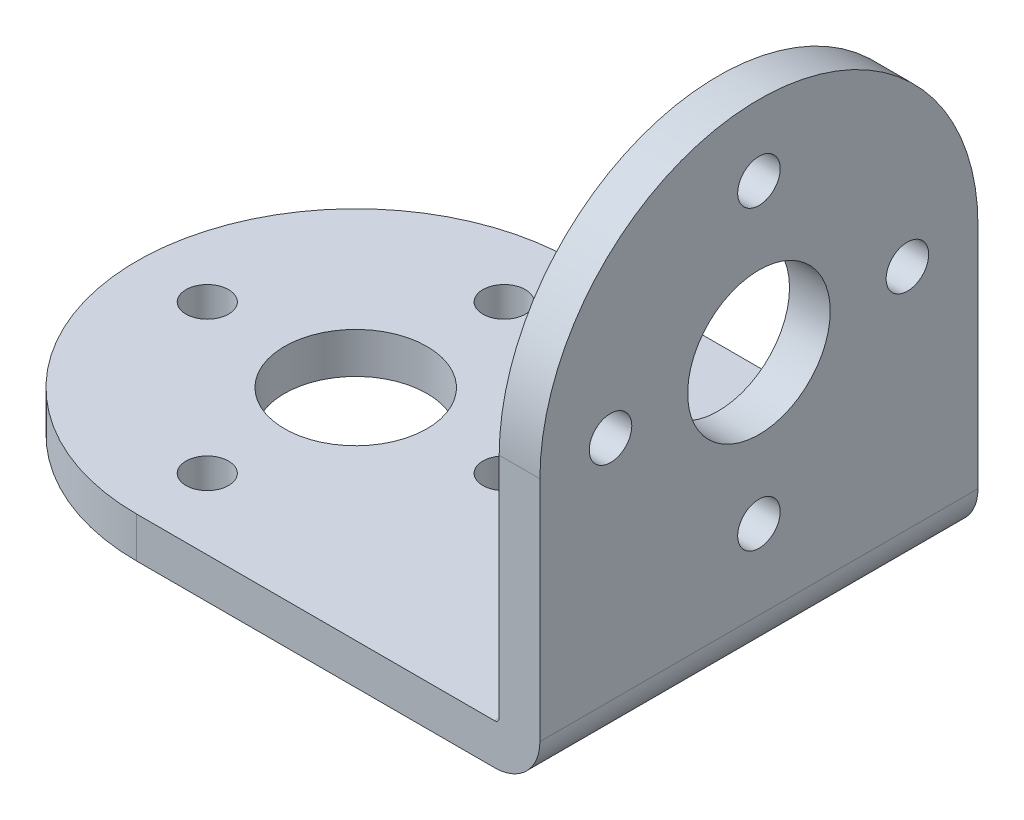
ISO-10303-21;
HEADER;
FILE_DESCRIPTION(('STEP AP214'),'2;1');
FILE_NAME('part.step','',(''),(''),'','','');
FILE_SCHEMA(('AUTOMOTIVE_DESIGN { 1 0 10303 214 1 1 1 1 }'));
ENDSEC;
DATA;
#1=APPLICATION_CONTEXT('core data for automotive mechanical design processes');
#2=APPLICATION_PROTOCOL_DEFINITION('international standard','automotive_design',2000,#1);
#3=PRODUCT_CONTEXT('',#1,'mechanical');
#4=PRODUCT('Part','Part','',(#3));
#5=PRODUCT_RELATED_PRODUCT_CATEGORY('part','',(#4));
#6=PRODUCT_DEFINITION_FORMATION('','',#4);
#7=PRODUCT_DEFINITION_CONTEXT('part definition',#1,'design');
#8=PRODUCT_DEFINITION('design','',#6,#7);
#9=PRODUCT_DEFINITION_SHAPE('','',#8);
#10=(LENGTH_UNIT() NAMED_UNIT(*) SI_UNIT(.MILLI.,.METRE.));
#11=(NAMED_UNIT(*) PLANE_ANGLE_UNIT() SI_UNIT($,.RADIAN.));
#12=(NAMED_UNIT(*) SI_UNIT($,.STERADIAN.) SOLID_ANGLE_UNIT());
#13=UNCERTAINTY_MEASURE_WITH_UNIT(LENGTH_MEASURE(1.E-05),#10,'distance_accuracy_value','');
#14=(GEOMETRIC_REPRESENTATION_CONTEXT(3) GLOBAL_UNCERTAINTY_ASSIGNED_CONTEXT((#13)) GLOBAL_UNIT_ASSIGNED_CONTEXT((#10,
#11,#12)) REPRESENTATION_CONTEXT('',''));
#15=CARTESIAN_POINT('',(0.,0.,0.));
#16=DIRECTION('',(0.,0.,1.));
#17=DIRECTION('',(1.,0.,0.));
#18=AXIS2_PLACEMENT_3D('',#15,#16,#17);
#19=CARTESIAN_POINT('',(-22.6314,2.286,0.));
#20=DIRECTION('',(0.,-1.,0.));
#21=DIRECTION('',(0.,0.,-1.));
#22=AXIS2_PLACEMENT_3D('',#19,#20,#21);
#23=PLANE('',#22);
#24=CARTESIAN_POINT('',(-22.6314,2.286,0.));
#25=DIRECTION('',(0.,1.,0.));
#26=DIRECTION('',(0.,0.,-1.));
#27=AXIS2_PLACEMENT_3D('',#24,#25,#26);
#28=CIRCLE('',#27,4.0005);
#29=CARTESIAN_POINT('',(-22.6314,2.286,-4.0005));
#30=VERTEX_POINT('',#29);
#31=EDGE_CURVE('E137',#30,#30,#28,.T.);
#32=ORIENTED_EDGE('',*,*,#31,.F.);
#33=EDGE_LOOP('',(#32));
#34=FACE_BOUND('',#33,.T.);
#35=CARTESIAN_POINT('',(-30.9626,2.286,0.));
#36=DIRECTION('',(0.,1.,0.));
#37=DIRECTION('',(0.,0.,-1.));
#38=AXIS2_PLACEMENT_3D('',#35,#36,#37);
#39=CIRCLE('',#38,1.19380000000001);
#40=CARTESIAN_POINT('',(-30.9626,2.286,-1.1938));
#41=VERTEX_POINT('',#40);
#42=EDGE_CURVE('E149',#41,#41,#39,.T.);
#43=ORIENTED_EDGE('',*,*,#42,.F.);
#44=EDGE_LOOP('',(#43));
#45=FACE_BOUND('',#44,.T.);
#46=CARTESIAN_POINT('',(-14.3002,2.286,0.));
#47=DIRECTION('',(0.,1.,0.));
#48=DIRECTION('',(0.,0.,-1.));
#49=AXIS2_PLACEMENT_3D('',#46,#47,#48);
#50=CIRCLE('',#49,1.19380000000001);
#51=CARTESIAN_POINT('',(-14.3002,2.286,-1.1938));
#52=VERTEX_POINT('',#51);
#53=EDGE_CURVE('E161',#52,#52,#50,.T.);
#54=ORIENTED_EDGE('',*,*,#53,.F.);
#55=EDGE_LOOP('',(#54));
#56=FACE_BOUND('',#55,.T.);
#57=CARTESIAN_POINT('',(-22.6314,2.286,8.33120000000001));
#58=DIRECTION('',(0.,1.,0.));
#59=DIRECTION('',(0.,0.,-1.));
#60=AXIS2_PLACEMENT_3D('',#57,#58,#59);
#61=CIRCLE('',#60,1.19380000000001);
#62=CARTESIAN_POINT('',(-22.6314,2.286,7.1374));
#63=VERTEX_POINT('',#62);
#64=EDGE_CURVE('E155',#63,#63,#61,.T.);
#65=ORIENTED_EDGE('',*,*,#64,.F.);
#66=EDGE_LOOP('',(#65));
#67=FACE_BOUND('',#66,.T.);
#68=CARTESIAN_POINT('',(-22.6314,2.286,-8.33119999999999));
#69=DIRECTION('',(0.,1.,0.));
#70=DIRECTION('',(0.,0.,-1.));
#71=AXIS2_PLACEMENT_3D('',#68,#69,#70);
#72=CIRCLE('',#71,1.1938);
#73=CARTESIAN_POINT('',(-22.6314,2.286,-9.525));
#74=VERTEX_POINT('',#73);
#75=EDGE_CURVE('E143',#74,#74,#72,.T.);
#76=ORIENTED_EDGE('',*,*,#75,.F.);
#77=EDGE_LOOP('',(#76));
#78=FACE_BOUND('',#77,.T.);
#79=DIRECTION('',(1.,0.,0.));
#80=VECTOR('',#79,1.);
#81=CARTESIAN_POINT('',(0.,2.286,12.2936));
#82=LINE('',#81,#80);
#83=CARTESIAN_POINT('',(-22.6314,2.286,12.2936));
#84=VERTEX_POINT('',#83);
#85=CARTESIAN_POINT('',(-2.54,2.286,12.2936));
#86=VERTEX_POINT('',#85);
#87=EDGE_CURVE('E106',#84,#86,#82,.T.);
#88=ORIENTED_EDGE('',*,*,#87,.T.);
#89=DIRECTION('',(0.,0.,1.));
#90=VECTOR('',#89,1.);
#91=CARTESIAN_POINT('',(-2.54,2.286,-12.2936));
#92=LINE('',#91,#90);
#93=CARTESIAN_POINT('',(-2.54000000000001,2.286,-12.2936));
#94=VERTEX_POINT('',#93);
#95=EDGE_CURVE('E185',#86,#94,#92,.F.);
#96=ORIENTED_EDGE('',*,*,#95,.T.);
#97=DIRECTION('',(-1.,0.,0.));
#98=VECTOR('',#97,1.);
#99=CARTESIAN_POINT('',(-22.6314,2.286,-12.2936));
#100=LINE('',#99,#98);
#101=CARTESIAN_POINT('',(-22.6314,2.286,-12.2936));
#102=VERTEX_POINT('',#101);
#103=EDGE_CURVE('E170',#94,#102,#100,.T.);
#104=ORIENTED_EDGE('',*,*,#103,.T.);
#105=CARTESIAN_POINT('',(-22.6314,2.286,0.));
#106=DIRECTION('',(0.,1.,0.));
#107=DIRECTION('',(0.,0.,-1.));
#108=AXIS2_PLACEMENT_3D('',#105,#106,#107);
#109=CIRCLE('',#108,12.2936);
#110=EDGE_CURVE('E172',#102,#84,#109,.T.);
#111=ORIENTED_EDGE('',*,*,#110,.T.);
#112=EDGE_LOOP('',(#88,#96,#104,#111));
#113=FACE_BOUND('',#112,.T.);
#114=ADVANCED_FACE('F31',(#34,#45,#56,#67,#78,#113),#23,.F.);
#115=CARTESIAN_POINT('',(-22.6314,0.,0.));
#116=DIRECTION('',(0.,-1.,0.));
#117=DIRECTION('',(0.,0.,-1.));
#118=AXIS2_PLACEMENT_3D('',#115,#116,#117);
#119=PLANE('',#118);
#120=DIRECTION('',(-1.,0.,0.));
#121=VECTOR('',#120,1.);
#122=CARTESIAN_POINT('',(-22.6314,0.,-12.2936));
#123=LINE('',#122,#121);
#124=CARTESIAN_POINT('',(-2.54000000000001,0.,-12.2936));
#125=VERTEX_POINT('',#124);
#126=CARTESIAN_POINT('',(-22.6314,0.,-12.2936));
#127=VERTEX_POINT('',#126);
#128=EDGE_CURVE('E164',#125,#127,#123,.T.);
#129=ORIENTED_EDGE('',*,*,#128,.F.);
#130=DIRECTION('',(0.,0.,-1.));
#131=VECTOR('',#130,1.);
#132=CARTESIAN_POINT('',(-2.54,0.,12.2936));
#133=LINE('',#132,#131);
#134=CARTESIAN_POINT('',(-2.54,0.,12.2936));
#135=VERTEX_POINT('',#134);
#136=EDGE_CURVE('E39',#125,#135,#133,.F.);
#137=ORIENTED_EDGE('',*,*,#136,.T.);
#138=DIRECTION('',(1.,0.,0.));
#139=VECTOR('',#138,1.);
#140=CARTESIAN_POINT('',(0.,0.,12.2936));
#141=LINE('',#140,#139);
#142=CARTESIAN_POINT('',(-22.6314,0.,12.2936));
#143=VERTEX_POINT('',#142);
#144=EDGE_CURVE('E168',#143,#135,#141,.T.);
#145=ORIENTED_EDGE('',*,*,#144,.F.);
#146=CARTESIAN_POINT('',(-22.6314,0.,0.));
#147=DIRECTION('',(0.,1.,0.));
#148=DIRECTION('',(0.,0.,-1.));
#149=AXIS2_PLACEMENT_3D('',#146,#147,#148);
#150=CIRCLE('',#149,12.2936);
#151=EDGE_CURVE('E166',#127,#143,#150,.T.);
#152=ORIENTED_EDGE('',*,*,#151,.F.);
#153=EDGE_LOOP('',(#129,#137,#145,#152));
#154=FACE_BOUND('',#153,.T.);
#155=CARTESIAN_POINT('',(-22.6314,0.,0.));
#156=DIRECTION('',(0.,1.,0.));
#157=DIRECTION('',(0.,0.,-1.));
#158=AXIS2_PLACEMENT_3D('',#155,#156,#157);
#159=CIRCLE('',#158,4.0005);
#160=CARTESIAN_POINT('',(-22.6314,0.,-4.0005));
#161=VERTEX_POINT('',#160);
#162=EDGE_CURVE('E133',#161,#161,#159,.T.);
#163=ORIENTED_EDGE('',*,*,#162,.T.);
#164=EDGE_LOOP('',(#163));
#165=FACE_BOUND('',#164,.T.);
#166=CARTESIAN_POINT('',(-30.9626,0.,0.));
#167=DIRECTION('',(0.,1.,0.));
#168=DIRECTION('',(0.,0.,-1.));
#169=AXIS2_PLACEMENT_3D('',#166,#167,#168);
#170=CIRCLE('',#169,1.19380000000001);
#171=CARTESIAN_POINT('',(-30.9626,0.,-1.1938));
#172=VERTEX_POINT('',#171);
#173=EDGE_CURVE('E146',#172,#172,#170,.T.);
#174=ORIENTED_EDGE('',*,*,#173,.T.);
#175=EDGE_LOOP('',(#174));
#176=FACE_BOUND('',#175,.T.);
#177=CARTESIAN_POINT('',(-14.3002,0.,0.));
#178=DIRECTION('',(0.,1.,0.));
#179=DIRECTION('',(0.,0.,-1.));
#180=AXIS2_PLACEMENT_3D('',#177,#178,#179);
#181=CIRCLE('',#180,1.19380000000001);
#182=CARTESIAN_POINT('',(-14.3002,0.,-1.1938));
#183=VERTEX_POINT('',#182);
#184=EDGE_CURVE('E158',#183,#183,#181,.T.);
#185=ORIENTED_EDGE('',*,*,#184,.T.);
#186=EDGE_LOOP('',(#185));
#187=FACE_BOUND('',#186,.T.);
#188=CARTESIAN_POINT('',(-22.6314,0.,8.33120000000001));
#189=DIRECTION('',(0.,1.,0.));
#190=DIRECTION('',(0.,0.,-1.));
#191=AXIS2_PLACEMENT_3D('',#188,#189,#190);
#192=CIRCLE('',#191,1.19380000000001);
#193=CARTESIAN_POINT('',(-22.6314,0.,7.1374));
#194=VERTEX_POINT('',#193);
#195=EDGE_CURVE('E152',#194,#194,#192,.T.);
#196=ORIENTED_EDGE('',*,*,#195,.T.);
#197=EDGE_LOOP('',(#196));
#198=FACE_BOUND('',#197,.T.);
#199=CARTESIAN_POINT('',(-22.6314,0.,-8.33119999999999));
#200=DIRECTION('',(0.,1.,0.));
#201=DIRECTION('',(0.,0.,-1.));
#202=AXIS2_PLACEMENT_3D('',#199,#200,#201);
#203=CIRCLE('',#202,1.1938);
#204=CARTESIAN_POINT('',(-22.6314,0.,-9.525));
#205=VERTEX_POINT('',#204);
#206=EDGE_CURVE('E140',#205,#205,#203,.T.);
#207=ORIENTED_EDGE('',*,*,#206,.T.);
#208=EDGE_LOOP('',(#207));
#209=FACE_BOUND('',#208,.T.);
#210=ADVANCED_FACE('F212',(#154,#165,#176,#187,#198,#209),#119,.T.);
#211=CARTESIAN_POINT('',(0.,2.286,-12.2936));
#212=DIRECTION('',(-1.,0.,0.));
#213=DIRECTION('',(0.,0.,1.));
#214=AXIS2_PLACEMENT_3D('',#211,#212,#213);
#215=PLANE('',#214);
#216=DIRECTION('',(0.,-1.,0.));
#217=VECTOR('',#216,1.);
#218=CARTESIAN_POINT('',(0.,2.286,12.2936));
#219=LINE('',#218,#217);
#220=CARTESIAN_POINT('',(0.,15.3162,12.2936));
#221=VERTEX_POINT('',#220);
#222=CARTESIAN_POINT('',(0.,2.54,12.2936));
#223=VERTEX_POINT('',#222);
#224=EDGE_CURVE('E94',#221,#223,#219,.T.);
#225=ORIENTED_EDGE('',*,*,#224,.T.);
#226=DIRECTION('',(0.,0.,-1.));
#227=VECTOR('',#226,1.);
#228=CARTESIAN_POINT('',(0.,2.54,-12.2936));
#229=LINE('',#228,#227);
#230=CARTESIAN_POINT('',(0.,2.54,-12.2936));
#231=VERTEX_POINT('',#230);
#232=EDGE_CURVE('E191',#223,#231,#229,.T.);
#233=ORIENTED_EDGE('',*,*,#232,.T.);
#234=DIRECTION('',(0.,-1.,0.));
#235=VECTOR('',#234,1.);
#236=CARTESIAN_POINT('',(0.,2.286,-12.2936));
#237=LINE('',#236,#235);
#238=CARTESIAN_POINT('',(0.,15.3162,-12.2936));
#239=VERTEX_POINT('',#238);
#240=EDGE_CURVE('E120',#239,#231,#237,.T.);
#241=ORIENTED_EDGE('',*,*,#240,.F.);
#242=CARTESIAN_POINT('',(0.,15.3162,0.));
#243=DIRECTION('',(1.,0.,0.));
#244=DIRECTION('',(0.,0.,-1.));
#245=AXIS2_PLACEMENT_3D('',#242,#243,#244);
#246=CIRCLE('',#245,12.2936);
#247=EDGE_CURVE('E113',#239,#221,#246,.T.);
#248=ORIENTED_EDGE('',*,*,#247,.T.);
#249=EDGE_LOOP('',(#225,#233,#241,#248));
#250=FACE_BOUND('',#249,.T.);
#251=CARTESIAN_POINT('',(0.,15.3162,0.));
#252=DIRECTION('',(1.,0.,0.));
#253=DIRECTION('',(0.,0.,-1.));
#254=AXIS2_PLACEMENT_3D('',#251,#252,#253);
#255=CIRCLE('',#254,4.0005);
#256=CARTESIAN_POINT('',(0.,15.3162,-4.00050000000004));
#257=VERTEX_POINT('',#256);
#258=EDGE_CURVE('E127',#257,#257,#255,.T.);
#259=ORIENTED_EDGE('',*,*,#258,.F.);
#260=EDGE_LOOP('',(#259));
#261=FACE_BOUND('',#260,.T.);
#262=CARTESIAN_POINT('',(0.,15.3162,8.33119999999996));
#263=DIRECTION('',(1.,0.,0.));
#264=DIRECTION('',(0.,0.,-1.));
#265=AXIS2_PLACEMENT_3D('',#262,#263,#264);
#266=CIRCLE('',#265,1.1938);
#267=CARTESIAN_POINT('',(0.,15.3162,7.13739999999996));
#268=VERTEX_POINT('',#267);
#269=EDGE_CURVE('E433',#268,#268,#266,.T.);
#270=ORIENTED_EDGE('',*,*,#269,.F.);
#271=EDGE_LOOP('',(#270));
#272=FACE_BOUND('',#271,.T.);
#273=CARTESIAN_POINT('',(0.,23.6474,0.));
#274=DIRECTION('',(1.,0.,0.));
#275=DIRECTION('',(0.,0.,-1.));
#276=AXIS2_PLACEMENT_3D('',#273,#274,#275);
#277=CIRCLE('',#276,1.19380000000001);
#278=CARTESIAN_POINT('',(0.,23.6474,-1.19380000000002));
#279=VERTEX_POINT('',#278);
#280=EDGE_CURVE('E441',#279,#279,#277,.T.);
#281=ORIENTED_EDGE('',*,*,#280,.F.);
#282=EDGE_LOOP('',(#281));
#283=FACE_BOUND('',#282,.T.);
#284=CARTESIAN_POINT('',(0.,15.3162,-8.33120000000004));
#285=DIRECTION('',(1.,0.,0.));
#286=DIRECTION('',(0.,0.,-1.));
#287=AXIS2_PLACEMENT_3D('',#284,#285,#286);
#288=CIRCLE('',#287,1.1938);
#289=CARTESIAN_POINT('',(0.,15.3162,-9.52500000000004));
#290=VERTEX_POINT('',#289);
#291=EDGE_CURVE('E447',#290,#290,#288,.T.);
#292=ORIENTED_EDGE('',*,*,#291,.F.);
#293=EDGE_LOOP('',(#292));
#294=FACE_BOUND('',#293,.T.);
#295=CARTESIAN_POINT('',(0.,6.985,0.));
#296=DIRECTION('',(1.,0.,0.));
#297=DIRECTION('',(0.,0.,-1.));
#298=AXIS2_PLACEMENT_3D('',#295,#296,#297);
#299=CIRCLE('',#298,1.19380000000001);
#300=CARTESIAN_POINT('',(0.,6.985,-1.19380000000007));
#301=VERTEX_POINT('',#300);
#302=EDGE_CURVE('E453',#301,#301,#299,.T.);
#303=ORIENTED_EDGE('',*,*,#302,.F.);
#304=EDGE_LOOP('',(#303));
#305=FACE_BOUND('',#304,.T.);
#306=ADVANCED_FACE('F33',(#250,#261,#272,#283,#294,#305),#215,.F.);
#307=CARTESIAN_POINT('',(-22.6314,2.286,-12.2936));
#308=DIRECTION('',(0.,0.,1.));
#309=DIRECTION('',(1.,0.,0.));
#310=AXIS2_PLACEMENT_3D('',#307,#308,#309);
#311=PLANE('',#310);
#312=ORIENTED_EDGE('',*,*,#240,.T.);
#313=CARTESIAN_POINT('',(-2.54,2.54,-12.2936));
#314=DIRECTION('',(0.,0.,1.));
#315=DIRECTION('',(1.,0.,0.));
#316=AXIS2_PLACEMENT_3D('',#313,#314,#315);
#317=CIRCLE('',#316,2.54);
#318=EDGE_CURVE('E53',#231,#125,#317,.F.);
#319=ORIENTED_EDGE('',*,*,#318,.T.);
#320=ORIENTED_EDGE('',*,*,#128,.T.);
#321=DIRECTION('',(0.,-1.,0.));
#322=VECTOR('',#321,1.);
#323=CARTESIAN_POINT('',(-22.6314,2.286,-12.2936));
#324=LINE('',#323,#322);
#325=EDGE_CURVE('E178',#102,#127,#324,.T.);
#326=ORIENTED_EDGE('',*,*,#325,.F.);
#327=ORIENTED_EDGE('',*,*,#103,.F.);
#328=CARTESIAN_POINT('',(-2.54,2.54,-12.2936));
#329=DIRECTION('',(0.,0.,1.));
#330=DIRECTION('',(1.,0.,0.));
#331=AXIS2_PLACEMENT_3D('',#328,#329,#330);
#332=CIRCLE('',#331,0.254);
#333=CARTESIAN_POINT('',(-2.286,2.54,-12.2936));
#334=VERTEX_POINT('',#333);
#335=EDGE_CURVE('E189',#94,#334,#332,.T.);
#336=ORIENTED_EDGE('',*,*,#335,.T.);
#337=DIRECTION('',(0.,1.,0.));
#338=VECTOR('',#337,1.);
#339=CARTESIAN_POINT('',(-2.286,0.,-12.2936));
#340=LINE('',#339,#338);
#341=CARTESIAN_POINT('',(-2.286,15.3162,-12.2936));
#342=VERTEX_POINT('',#341);
#343=EDGE_CURVE('E117',#334,#342,#340,.T.);
#344=ORIENTED_EDGE('',*,*,#343,.T.);
#345=DIRECTION('',(1.,0.,0.));
#346=VECTOR('',#345,1.);
#347=CARTESIAN_POINT('',(-2.286,15.3162,-12.2936));
#348=LINE('',#347,#346);
#349=EDGE_CURVE('E116',#342,#239,#348,.T.);
#350=ORIENTED_EDGE('',*,*,#349,.T.);
#351=EDGE_LOOP('',(#312,#319,#320,#326,#327,#336,#344,#350));
#352=FACE_BOUND('',#351,.T.);
#353=ADVANCED_FACE('F194',(#352),#311,.F.);
#354=CARTESIAN_POINT('',(-22.6314,2.286,0.));
#355=DIRECTION('',(0.,-1.,0.));
#356=DIRECTION('',(0.,0.,-1.));
#357=AXIS2_PLACEMENT_3D('',#354,#355,#356);
#358=CYLINDRICAL_SURFACE('',#357,12.2936);
#359=ORIENTED_EDGE('',*,*,#151,.T.);
#360=DIRECTION('',(0.,-1.,0.));
#361=VECTOR('',#360,1.);
#362=CARTESIAN_POINT('',(-22.6314,2.286,12.2936));
#363=LINE('',#362,#361);
#364=EDGE_CURVE('E105',#84,#143,#363,.T.);
#365=ORIENTED_EDGE('',*,*,#364,.F.);
#366=ORIENTED_EDGE('',*,*,#110,.F.);
#367=ORIENTED_EDGE('',*,*,#325,.T.);
#368=EDGE_LOOP('',(#359,#365,#366,#367));
#369=FACE_BOUND('',#368,.T.);
#370=ADVANCED_FACE('F211',(#369),#358,.T.);
#371=CARTESIAN_POINT('',(0.,2.286,12.2936));
#372=DIRECTION('',(0.,0.,-1.));
#373=DIRECTION('',(-1.,0.,0.));
#374=AXIS2_PLACEMENT_3D('',#371,#372,#373);
#375=PLANE('',#374);
#376=ORIENTED_EDGE('',*,*,#144,.T.);
#377=CARTESIAN_POINT('',(-2.54,2.54,12.2936));
#378=DIRECTION('',(0.,0.,-1.));
#379=DIRECTION('',(-1.,0.,0.));
#380=AXIS2_PLACEMENT_3D('',#377,#378,#379);
#381=CIRCLE('',#380,2.54);
#382=EDGE_CURVE('E11',#135,#223,#381,.F.);
#383=ORIENTED_EDGE('',*,*,#382,.T.);
#384=ORIENTED_EDGE('',*,*,#224,.F.);
#385=DIRECTION('',(1.,0.,0.));
#386=VECTOR('',#385,1.);
#387=CARTESIAN_POINT('',(-2.286,15.3162,12.2936));
#388=LINE('',#387,#386);
#389=CARTESIAN_POINT('',(-2.286,15.3162,12.2936));
#390=VERTEX_POINT('',#389);
#391=EDGE_CURVE('E98',#390,#221,#388,.T.);
#392=ORIENTED_EDGE('',*,*,#391,.F.);
#393=DIRECTION('',(0.,-1.,0.));
#394=VECTOR('',#393,1.);
#395=CARTESIAN_POINT('',(-2.286,15.3162,12.2936));
#396=LINE('',#395,#394);
#397=CARTESIAN_POINT('',(-2.286,2.54,12.2936));
#398=VERTEX_POINT('',#397);
#399=EDGE_CURVE('E124',#390,#398,#396,.T.);
#400=ORIENTED_EDGE('',*,*,#399,.T.);
#401=CARTESIAN_POINT('',(-2.54,2.54,12.2936));
#402=DIRECTION('',(0.,0.,-1.));
#403=DIRECTION('',(-1.,0.,0.));
#404=AXIS2_PLACEMENT_3D('',#401,#402,#403);
#405=CIRCLE('',#404,0.254);
#406=EDGE_CURVE('E187',#398,#86,#405,.T.);
#407=ORIENTED_EDGE('',*,*,#406,.T.);
#408=ORIENTED_EDGE('',*,*,#87,.F.);
#409=ORIENTED_EDGE('',*,*,#364,.T.);
#410=EDGE_LOOP('',(#376,#383,#384,#392,#400,#407,#408,#409));
#411=FACE_BOUND('',#410,.T.);
#412=ADVANCED_FACE('F96',(#411),#375,.F.);
#413=CARTESIAN_POINT('',(-14.3002,2.286,0.));
#414=DIRECTION('',(0.,-1.,0.));
#415=DIRECTION('',(0.,0.,-1.));
#416=AXIS2_PLACEMENT_3D('',#413,#414,#415);
#417=CYLINDRICAL_SURFACE('',#416,1.19380000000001);
#418=ORIENTED_EDGE('',*,*,#53,.T.);
#419=EDGE_LOOP('',(#418));
#420=FACE_BOUND('',#419,.T.);
#421=ORIENTED_EDGE('',*,*,#184,.F.);
#422=EDGE_LOOP('',(#421));
#423=FACE_BOUND('',#422,.T.);
#424=ADVANCED_FACE('F235',(#420,#423),#417,.F.);
#425=CARTESIAN_POINT('',(-22.6314,2.286,8.33120000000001));
#426=DIRECTION('',(0.,-1.,0.));
#427=DIRECTION('',(0.,0.,-1.));
#428=AXIS2_PLACEMENT_3D('',#425,#426,#427);
#429=CYLINDRICAL_SURFACE('',#428,1.19380000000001);
#430=ORIENTED_EDGE('',*,*,#64,.T.);
#431=EDGE_LOOP('',(#430));
#432=FACE_BOUND('',#431,.T.);
#433=ORIENTED_EDGE('',*,*,#195,.F.);
#434=EDGE_LOOP('',(#433));
#435=FACE_BOUND('',#434,.T.);
#436=ADVANCED_FACE('F356',(#432,#435),#429,.F.);
#437=CARTESIAN_POINT('',(-30.9626,2.286,0.));
#438=DIRECTION('',(0.,-1.,0.));
#439=DIRECTION('',(0.,0.,-1.));
#440=AXIS2_PLACEMENT_3D('',#437,#438,#439);
#441=CYLINDRICAL_SURFACE('',#440,1.19380000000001);
#442=ORIENTED_EDGE('',*,*,#42,.T.);
#443=EDGE_LOOP('',(#442));
#444=FACE_BOUND('',#443,.T.);
#445=ORIENTED_EDGE('',*,*,#173,.F.);
#446=EDGE_LOOP('',(#445));
#447=FACE_BOUND('',#446,.T.);
#448=ADVANCED_FACE('F346',(#444,#447),#441,.F.);
#449=CARTESIAN_POINT('',(-22.6314,2.286,-8.33119999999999));
#450=DIRECTION('',(0.,-1.,0.));
#451=DIRECTION('',(0.,0.,-1.));
#452=AXIS2_PLACEMENT_3D('',#449,#450,#451);
#453=CYLINDRICAL_SURFACE('',#452,1.1938);
#454=ORIENTED_EDGE('',*,*,#75,.T.);
#455=EDGE_LOOP('',(#454));
#456=FACE_BOUND('',#455,.T.);
#457=ORIENTED_EDGE('',*,*,#206,.F.);
#458=EDGE_LOOP('',(#457));
#459=FACE_BOUND('',#458,.T.);
#460=ADVANCED_FACE('F336',(#456,#459),#453,.F.);
#461=CARTESIAN_POINT('',(-22.6314,2.286,0.));
#462=DIRECTION('',(0.,-1.,0.));
#463=DIRECTION('',(0.,0.,-1.));
#464=AXIS2_PLACEMENT_3D('',#461,#462,#463);
#465=CYLINDRICAL_SURFACE('',#464,4.0005);
#466=ORIENTED_EDGE('',*,*,#31,.T.);
#467=EDGE_LOOP('',(#466));
#468=FACE_BOUND('',#467,.T.);
#469=ORIENTED_EDGE('',*,*,#162,.F.);
#470=EDGE_LOOP('',(#469));
#471=FACE_BOUND('',#470,.T.);
#472=ADVANCED_FACE('F265',(#468,#471),#465,.F.);
#473=CARTESIAN_POINT('',(-2.286,15.3162,0.));
#474=DIRECTION('',(1.,0.,0.));
#475=DIRECTION('',(0.,0.,-1.));
#476=AXIS2_PLACEMENT_3D('',#473,#474,#475);
#477=PLANE('',#476);
#478=CARTESIAN_POINT('',(-2.286,15.3162,0.));
#479=DIRECTION('',(1.,0.,0.));
#480=DIRECTION('',(0.,0.,-1.));
#481=AXIS2_PLACEMENT_3D('',#478,#479,#480);
#482=CIRCLE('',#481,4.0005);
#483=CARTESIAN_POINT('',(-2.286,15.3162,-4.00050000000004));
#484=VERTEX_POINT('',#483);
#485=EDGE_CURVE('E122',#484,#484,#482,.T.);
#486=ORIENTED_EDGE('',*,*,#485,.T.);
#487=EDGE_LOOP('',(#486));
#488=FACE_BOUND('',#487,.T.);
#489=CARTESIAN_POINT('',(-2.286,15.3162,8.33119999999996));
#490=DIRECTION('',(1.,0.,0.));
#491=DIRECTION('',(0.,0.,-1.));
#492=AXIS2_PLACEMENT_3D('',#489,#490,#491);
#493=CIRCLE('',#492,1.1938);
#494=CARTESIAN_POINT('',(-2.286,15.3162,7.13739999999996));
#495=VERTEX_POINT('',#494);
#496=EDGE_CURVE('E431',#495,#495,#493,.T.);
#497=ORIENTED_EDGE('',*,*,#496,.T.);
#498=EDGE_LOOP('',(#497));
#499=FACE_BOUND('',#498,.T.);
#500=CARTESIAN_POINT('',(-2.286,23.6474,0.));
#501=DIRECTION('',(1.,0.,0.));
#502=DIRECTION('',(0.,0.,-1.));
#503=AXIS2_PLACEMENT_3D('',#500,#501,#502);
#504=CIRCLE('',#503,1.19380000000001);
#505=CARTESIAN_POINT('',(-2.286,23.6474,-1.19380000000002));
#506=VERTEX_POINT('',#505);
#507=EDGE_CURVE('E438',#506,#506,#504,.T.);
#508=ORIENTED_EDGE('',*,*,#507,.T.);
#509=EDGE_LOOP('',(#508));
#510=FACE_BOUND('',#509,.T.);
#511=CARTESIAN_POINT('',(-2.286,15.3162,-8.33120000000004));
#512=DIRECTION('',(1.,0.,0.));
#513=DIRECTION('',(0.,0.,-1.));
#514=AXIS2_PLACEMENT_3D('',#511,#512,#513);
#515=CIRCLE('',#514,1.1938);
#516=CARTESIAN_POINT('',(-2.286,15.3162,-9.52500000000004));
#517=VERTEX_POINT('',#516);
#518=EDGE_CURVE('E444',#517,#517,#515,.T.);
#519=ORIENTED_EDGE('',*,*,#518,.T.);
#520=EDGE_LOOP('',(#519));
#521=FACE_BOUND('',#520,.T.);
#522=CARTESIAN_POINT('',(-2.286,6.985,0.));
#523=DIRECTION('',(1.,0.,0.));
#524=DIRECTION('',(0.,0.,-1.));
#525=AXIS2_PLACEMENT_3D('',#522,#523,#524);
#526=CIRCLE('',#525,1.19380000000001);
#527=CARTESIAN_POINT('',(-2.286,6.985,-1.19380000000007));
#528=VERTEX_POINT('',#527);
#529=EDGE_CURVE('E450',#528,#528,#526,.T.);
#530=ORIENTED_EDGE('',*,*,#529,.T.);
#531=EDGE_LOOP('',(#530));
#532=FACE_BOUND('',#531,.T.);
#533=ORIENTED_EDGE('',*,*,#343,.F.);
#534=DIRECTION('',(0.,0.,1.));
#535=VECTOR('',#534,1.);
#536=CARTESIAN_POINT('',(-2.286,2.54,12.2936));
#537=LINE('',#536,#535);
#538=EDGE_CURVE('E182',#334,#398,#537,.T.);
#539=ORIENTED_EDGE('',*,*,#538,.T.);
#540=ORIENTED_EDGE('',*,*,#399,.F.);
#541=CARTESIAN_POINT('',(-2.286,15.3162,0.));
#542=DIRECTION('',(1.,0.,0.));
#543=DIRECTION('',(0.,0.,-1.));
#544=AXIS2_PLACEMENT_3D('',#541,#542,#543);
#545=CIRCLE('',#544,12.2936);
#546=EDGE_CURVE('E115',#342,#390,#545,.T.);
#547=ORIENTED_EDGE('',*,*,#546,.F.);
#548=EDGE_LOOP('',(#533,#539,#540,#547));
#549=FACE_BOUND('',#548,.T.);
#550=ADVANCED_FACE('F197',(#488,#499,#510,#521,#532,#549),#477,.F.);
#551=CARTESIAN_POINT('',(-2.286,15.3162,0.));
#552=DIRECTION('',(1.,0.,0.));
#553=DIRECTION('',(0.,0.,-1.));
#554=AXIS2_PLACEMENT_3D('',#551,#552,#553);
#555=CYLINDRICAL_SURFACE('',#554,12.2936);
#556=ORIENTED_EDGE('',*,*,#247,.F.);
#557=ORIENTED_EDGE('',*,*,#349,.F.);
#558=ORIENTED_EDGE('',*,*,#546,.T.);
#559=ORIENTED_EDGE('',*,*,#391,.T.);
#560=EDGE_LOOP('',(#556,#557,#558,#559));
#561=FACE_BOUND('',#560,.T.);
#562=ADVANCED_FACE('F111',(#561),#555,.T.);
#563=CARTESIAN_POINT('',(-2.286,15.3162,0.));
#564=DIRECTION('',(1.,0.,0.));
#565=DIRECTION('',(0.,0.,-1.));
#566=AXIS2_PLACEMENT_3D('',#563,#564,#565);
#567=CYLINDRICAL_SURFACE('',#566,4.0005);
#568=ORIENTED_EDGE('',*,*,#485,.F.);
#569=EDGE_LOOP('',(#568));
#570=FACE_BOUND('',#569,.T.);
#571=ORIENTED_EDGE('',*,*,#258,.T.);
#572=EDGE_LOOP('',(#571));
#573=FACE_BOUND('',#572,.T.);
#574=ADVANCED_FACE('F313',(#570,#573),#567,.F.);
#575=CARTESIAN_POINT('',(-2.286,15.3162,8.33119999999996));
#576=DIRECTION('',(1.,0.,0.));
#577=DIRECTION('',(0.,0.,-1.));
#578=AXIS2_PLACEMENT_3D('',#575,#576,#577);
#579=CYLINDRICAL_SURFACE('',#578,1.1938);
#580=ORIENTED_EDGE('',*,*,#496,.F.);
#581=EDGE_LOOP('',(#580));
#582=FACE_BOUND('',#581,.T.);
#583=ORIENTED_EDGE('',*,*,#269,.T.);
#584=EDGE_LOOP('',(#583));
#585=FACE_BOUND('',#584,.T.);
#586=ADVANCED_FACE('F303',(#582,#585),#579,.F.);
#587=CARTESIAN_POINT('',(-2.286,23.6474,0.));
#588=DIRECTION('',(1.,0.,0.));
#589=DIRECTION('',(0.,0.,-1.));
#590=AXIS2_PLACEMENT_3D('',#587,#588,#589);
#591=CYLINDRICAL_SURFACE('',#590,1.19380000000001);
#592=ORIENTED_EDGE('',*,*,#507,.F.);
#593=EDGE_LOOP('',(#592));
#594=FACE_BOUND('',#593,.T.);
#595=ORIENTED_EDGE('',*,*,#280,.T.);
#596=EDGE_LOOP('',(#595));
#597=FACE_BOUND('',#596,.T.);
#598=ADVANCED_FACE('F293',(#594,#597),#591,.F.);
#599=CARTESIAN_POINT('',(-2.286,15.3162,-8.33120000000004));
#600=DIRECTION('',(1.,0.,0.));
#601=DIRECTION('',(0.,0.,-1.));
#602=AXIS2_PLACEMENT_3D('',#599,#600,#601);
#603=CYLINDRICAL_SURFACE('',#602,1.1938);
#604=ORIENTED_EDGE('',*,*,#518,.F.);
#605=EDGE_LOOP('',(#604));
#606=FACE_BOUND('',#605,.T.);
#607=ORIENTED_EDGE('',*,*,#291,.T.);
#608=EDGE_LOOP('',(#607));
#609=FACE_BOUND('',#608,.T.);
#610=ADVANCED_FACE('F283',(#606,#609),#603,.F.);
#611=CARTESIAN_POINT('',(-2.286,6.985,0.));
#612=DIRECTION('',(1.,0.,0.));
#613=DIRECTION('',(0.,0.,-1.));
#614=AXIS2_PLACEMENT_3D('',#611,#612,#613);
#615=CYLINDRICAL_SURFACE('',#614,1.19380000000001);
#616=ORIENTED_EDGE('',*,*,#529,.F.);
#617=EDGE_LOOP('',(#616));
#618=FACE_BOUND('',#617,.T.);
#619=ORIENTED_EDGE('',*,*,#302,.T.);
#620=EDGE_LOOP('',(#619));
#621=FACE_BOUND('',#620,.T.);
#622=ADVANCED_FACE('F220',(#618,#621),#615,.F.);
#623=CARTESIAN_POINT('',(-2.54,2.54,0.));
#624=DIRECTION('',(0.,0.,-1.));
#625=DIRECTION('',(-1.,0.,0.));
#626=AXIS2_PLACEMENT_3D('',#623,#624,#625);
#627=CYLINDRICAL_SURFACE('',#626,0.254);
#628=ORIENTED_EDGE('',*,*,#335,.F.);
#629=ORIENTED_EDGE('',*,*,#95,.F.);
#630=ORIENTED_EDGE('',*,*,#406,.F.);
#631=ORIENTED_EDGE('',*,*,#538,.F.);
#632=EDGE_LOOP('',(#628,#629,#630,#631));
#633=FACE_BOUND('',#632,.T.);
#634=ADVANCED_FACE('F207',(#633),#627,.F.);
#635=CARTESIAN_POINT('',(-2.54,2.54,-12.2936));
#636=DIRECTION('',(0.,0.,1.));
#637=DIRECTION('',(1.,0.,0.));
#638=AXIS2_PLACEMENT_3D('',#635,#636,#637);
#639=CYLINDRICAL_SURFACE('',#638,2.54);
#640=ORIENTED_EDGE('',*,*,#382,.F.);
#641=ORIENTED_EDGE('',*,*,#136,.F.);
#642=ORIENTED_EDGE('',*,*,#318,.F.);
#643=ORIENTED_EDGE('',*,*,#232,.F.);
#644=EDGE_LOOP('',(#640,#641,#642,#643));
#645=FACE_BOUND('',#644,.T.);
#646=ADVANCED_FACE('F214',(#645),#639,.T.);
#647=CLOSED_SHELL('',(#114,#210,#306,#353,#370,#412,#424,#436,#448,#460,#472,#550,#562,#574,
#586,#598,#610,#622,#634,#646));
#648=MANIFOLD_SOLID_BREP('B2',#647);
#649=ADVANCED_BREP_SHAPE_REPRESENTATION('',(#18,#648),#14);
#650=SHAPE_DEFINITION_REPRESENTATION(#9,#649);
ENDSEC;
END-ISO-10303-21;
